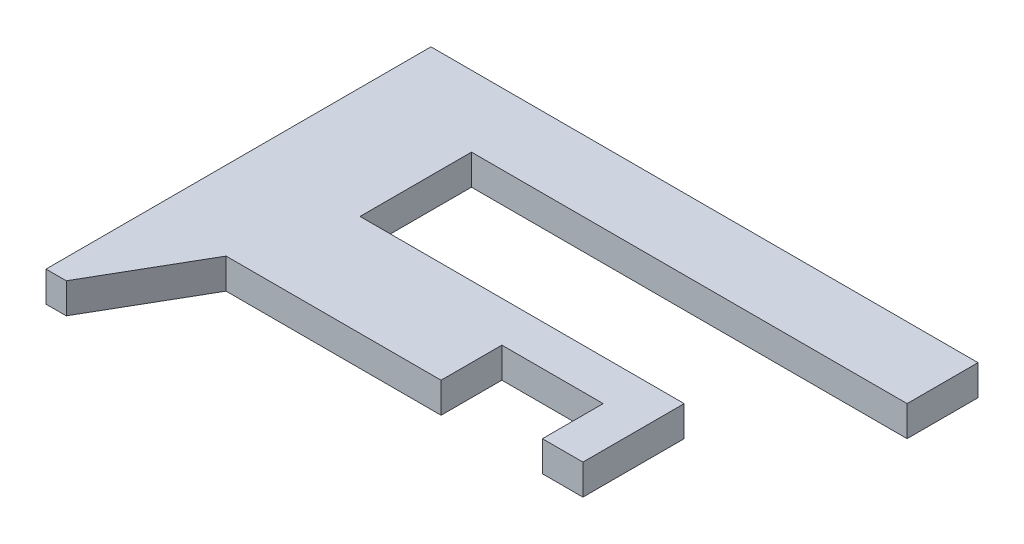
ISO-10303-21;
HEADER;
FILE_DESCRIPTION(('STEP AP214'),'2;1');
FILE_NAME('part.step','',(''),(''),'','','');
FILE_SCHEMA(('AUTOMOTIVE_DESIGN { 1 0 10303 214 1 1 1 1 }'));
ENDSEC;
DATA;
#1=APPLICATION_CONTEXT('core data for automotive mechanical design processes');
#2=APPLICATION_PROTOCOL_DEFINITION('international standard','automotive_design',2000,#1);
#3=PRODUCT_CONTEXT('',#1,'mechanical');
#4=PRODUCT('Part','Part','',(#3));
#5=PRODUCT_RELATED_PRODUCT_CATEGORY('part','',(#4));
#6=PRODUCT_DEFINITION_FORMATION('','',#4);
#7=PRODUCT_DEFINITION_CONTEXT('part definition',#1,'design');
#8=PRODUCT_DEFINITION('design','',#6,#7);
#9=PRODUCT_DEFINITION_SHAPE('','',#8);
#10=(LENGTH_UNIT() NAMED_UNIT(*) SI_UNIT(.MILLI.,.METRE.));
#11=(NAMED_UNIT(*) PLANE_ANGLE_UNIT() SI_UNIT($,.RADIAN.));
#12=(NAMED_UNIT(*) SI_UNIT($,.STERADIAN.) SOLID_ANGLE_UNIT());
#13=UNCERTAINTY_MEASURE_WITH_UNIT(LENGTH_MEASURE(1.E-05),#10,'distance_accuracy_value','');
#14=(GEOMETRIC_REPRESENTATION_CONTEXT(3) GLOBAL_UNCERTAINTY_ASSIGNED_CONTEXT((#13)) GLOBAL_UNIT_ASSIGNED_CONTEXT((#10,
#11,#12)) REPRESENTATION_CONTEXT('',''));
#15=CARTESIAN_POINT('',(0.,0.,0.));
#16=DIRECTION('',(0.,0.,1.));
#17=DIRECTION('',(1.,0.,0.));
#18=AXIS2_PLACEMENT_3D('',#15,#16,#17);
#19=CARTESIAN_POINT('',(0.,3.,-38.));
#20=DIRECTION('',(1.,0.,0.));
#21=DIRECTION('',(0.,0.,-1.));
#22=AXIS2_PLACEMENT_3D('',#19,#20,#21);
#23=PLANE('',#22);
#24=DIRECTION('',(0.,0.,1.));
#25=VECTOR('',#24,1.);
#26=CARTESIAN_POINT('',(0.,0.,-38.));
#27=LINE('',#26,#25);
#28=CARTESIAN_POINT('',(0.,0.,-38.));
#29=VERTEX_POINT('',#28);
#30=CARTESIAN_POINT('',(0.,0.,0.));
#31=VERTEX_POINT('',#30);
#32=EDGE_CURVE('E163',#29,#31,#27,.T.);
#33=ORIENTED_EDGE('',*,*,#32,.T.);
#34=DIRECTION('',(0.,-1.,0.));
#35=VECTOR('',#34,1.);
#36=CARTESIAN_POINT('',(0.,3.,0.));
#37=LINE('',#36,#35);
#38=CARTESIAN_POINT('',(0.,3.,0.));
#39=VERTEX_POINT('',#38);
#40=EDGE_CURVE('E11',#39,#31,#37,.T.);
#41=ORIENTED_EDGE('',*,*,#40,.F.);
#42=DIRECTION('',(0.,0.,1.));
#43=VECTOR('',#42,1.);
#44=CARTESIAN_POINT('',(0.,3.,-38.));
#45=LINE('',#44,#43);
#46=CARTESIAN_POINT('',(0.,3.,-38.));
#47=VERTEX_POINT('',#46);
#48=EDGE_CURVE('E189',#47,#39,#45,.T.);
#49=ORIENTED_EDGE('',*,*,#48,.F.);
#50=DIRECTION('',(0.,-1.,0.));
#51=VECTOR('',#50,1.);
#52=CARTESIAN_POINT('',(0.,3.,-38.));
#53=LINE('',#52,#51);
#54=EDGE_CURVE('E159',#47,#29,#53,.T.);
#55=ORIENTED_EDGE('',*,*,#54,.T.);
#56=EDGE_LOOP('',(#33,#41,#49,#55));
#57=FACE_BOUND('',#56,.T.);
#58=ADVANCED_FACE('F31',(#57),#23,.F.);
#59=CARTESIAN_POINT('',(0.,3.,0.));
#60=DIRECTION('',(0.,0.,-1.));
#61=DIRECTION('',(-1.,0.,0.));
#62=AXIS2_PLACEMENT_3D('',#59,#60,#61);
#63=PLANE('',#62);
#64=DIRECTION('',(1.,0.,0.));
#65=VECTOR('',#64,1.);
#66=CARTESIAN_POINT('',(0.,0.,0.));
#67=LINE('',#66,#65);
#68=CARTESIAN_POINT('',(2.,0.,0.));
#69=VERTEX_POINT('',#68);
#70=EDGE_CURVE('E166',#31,#69,#67,.T.);
#71=ORIENTED_EDGE('',*,*,#70,.T.);
#72=DIRECTION('',(0.,-1.,0.));
#73=VECTOR('',#72,1.);
#74=CARTESIAN_POINT('',(2.,3.,0.));
#75=LINE('',#74,#73);
#76=CARTESIAN_POINT('',(2.,3.,0.));
#77=VERTEX_POINT('',#76);
#78=EDGE_CURVE('E39',#77,#69,#75,.T.);
#79=ORIENTED_EDGE('',*,*,#78,.F.);
#80=DIRECTION('',(1.,0.,0.));
#81=VECTOR('',#80,1.);
#82=CARTESIAN_POINT('',(0.,3.,0.));
#83=LINE('',#82,#81);
#84=EDGE_CURVE('E108',#39,#77,#83,.T.);
#85=ORIENTED_EDGE('',*,*,#84,.F.);
#86=ORIENTED_EDGE('',*,*,#40,.T.);
#87=EDGE_LOOP('',(#71,#79,#85,#86));
#88=FACE_BOUND('',#87,.T.);
#89=ADVANCED_FACE('F277',(#88),#63,.F.);
#90=CARTESIAN_POINT('',(2.,3.,0.));
#91=DIRECTION('',(-0.86602540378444,0.,-0.499999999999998));
#92=DIRECTION('',(-0.499999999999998,0.,0.86602540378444));
#93=AXIS2_PLACEMENT_3D('',#90,#91,#92);
#94=PLANE('',#93);
#95=DIRECTION('',(0.499999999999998,0.,-0.86602540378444));
#96=VECTOR('',#95,1.);
#97=CARTESIAN_POINT('',(2.,0.,0.));
#98=LINE('',#97,#96);
#99=CARTESIAN_POINT('',(7.77350269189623,0.,-10.));
#100=VERTEX_POINT('',#99);
#101=EDGE_CURVE('E168',#69,#100,#98,.T.);
#102=ORIENTED_EDGE('',*,*,#101,.T.);
#103=DIRECTION('',(0.,-1.,0.));
#104=VECTOR('',#103,1.);
#105=CARTESIAN_POINT('',(7.77350269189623,3.,-10.));
#106=LINE('',#105,#104);
#107=CARTESIAN_POINT('',(7.77350269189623,3.,-10.));
#108=VERTEX_POINT('',#107);
#109=EDGE_CURVE('E214',#108,#100,#106,.T.);
#110=ORIENTED_EDGE('',*,*,#109,.F.);
#111=DIRECTION('',(0.499999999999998,0.,-0.86602540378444));
#112=VECTOR('',#111,1.);
#113=CARTESIAN_POINT('',(2.,3.,0.));
#114=LINE('',#113,#112);
#115=EDGE_CURVE('E222',#77,#108,#114,.T.);
#116=ORIENTED_EDGE('',*,*,#115,.F.);
#117=ORIENTED_EDGE('',*,*,#78,.T.);
#118=EDGE_LOOP('',(#102,#110,#116,#117));
#119=FACE_BOUND('',#118,.T.);
#120=ADVANCED_FACE('F220',(#119),#94,.F.);
#121=CARTESIAN_POINT('',(7.77350269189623,3.,-10.));
#122=DIRECTION('',(0.,0.,-1.));
#123=DIRECTION('',(-1.,0.,0.));
#124=AXIS2_PLACEMENT_3D('',#121,#122,#123);
#125=PLANE('',#124);
#126=DIRECTION('',(1.,0.,0.));
#127=VECTOR('',#126,1.);
#128=CARTESIAN_POINT('',(7.77350269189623,0.,-10.));
#129=LINE('',#128,#127);
#130=CARTESIAN_POINT('',(29.,0.,-10.));
#131=VERTEX_POINT('',#130);
#132=EDGE_CURVE('E170',#100,#131,#129,.T.);
#133=ORIENTED_EDGE('',*,*,#132,.T.);
#134=DIRECTION('',(0.,-1.,0.));
#135=VECTOR('',#134,1.);
#136=CARTESIAN_POINT('',(29.,3.,-10.));
#137=LINE('',#136,#135);
#138=CARTESIAN_POINT('',(29.,3.,-10.));
#139=VERTEX_POINT('',#138);
#140=EDGE_CURVE('E211',#139,#131,#137,.T.);
#141=ORIENTED_EDGE('',*,*,#140,.F.);
#142=DIRECTION('',(1.,0.,0.));
#143=VECTOR('',#142,1.);
#144=CARTESIAN_POINT('',(7.77350269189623,3.,-10.));
#145=LINE('',#144,#143);
#146=EDGE_CURVE('E240',#108,#139,#145,.T.);
#147=ORIENTED_EDGE('',*,*,#146,.F.);
#148=ORIENTED_EDGE('',*,*,#109,.T.);
#149=EDGE_LOOP('',(#133,#141,#147,#148));
#150=FACE_BOUND('',#149,.T.);
#151=ADVANCED_FACE('F231',(#150),#125,.F.);
#152=CARTESIAN_POINT('',(29.,3.,-10.));
#153=DIRECTION('',(-1.,0.,0.));
#154=DIRECTION('',(0.,0.,1.));
#155=AXIS2_PLACEMENT_3D('',#152,#153,#154);
#156=PLANE('',#155);
#157=DIRECTION('',(0.,0.,-1.));
#158=VECTOR('',#157,1.);
#159=CARTESIAN_POINT('',(29.,0.,-10.));
#160=LINE('',#159,#158);
#161=CARTESIAN_POINT('',(29.,0.,-16.));
#162=VERTEX_POINT('',#161);
#163=EDGE_CURVE('E172',#131,#162,#160,.T.);
#164=ORIENTED_EDGE('',*,*,#163,.T.);
#165=DIRECTION('',(0.,-1.,0.));
#166=VECTOR('',#165,1.);
#167=CARTESIAN_POINT('',(29.,3.,-16.));
#168=LINE('',#167,#166);
#169=CARTESIAN_POINT('',(29.,3.,-16.));
#170=VERTEX_POINT('',#169);
#171=EDGE_CURVE('E208',#170,#162,#168,.T.);
#172=ORIENTED_EDGE('',*,*,#171,.F.);
#173=DIRECTION('',(0.,0.,-1.));
#174=VECTOR('',#173,1.);
#175=CARTESIAN_POINT('',(29.,3.,-10.));
#176=LINE('',#175,#174);
#177=EDGE_CURVE('E237',#139,#170,#176,.T.);
#178=ORIENTED_EDGE('',*,*,#177,.F.);
#179=ORIENTED_EDGE('',*,*,#140,.T.);
#180=EDGE_LOOP('',(#164,#172,#178,#179));
#181=FACE_BOUND('',#180,.T.);
#182=ADVANCED_FACE('F235',(#181),#156,.F.);
#183=CARTESIAN_POINT('',(29.,3.,-16.));
#184=DIRECTION('',(0.,0.,-1.));
#185=DIRECTION('',(-1.,0.,0.));
#186=AXIS2_PLACEMENT_3D('',#183,#184,#185);
#187=PLANE('',#186);
#188=DIRECTION('',(1.,0.,0.));
#189=VECTOR('',#188,1.);
#190=CARTESIAN_POINT('',(29.,0.,-16.));
#191=LINE('',#190,#189);
#192=CARTESIAN_POINT('',(39.,0.,-16.));
#193=VERTEX_POINT('',#192);
#194=EDGE_CURVE('E174',#162,#193,#191,.T.);
#195=ORIENTED_EDGE('',*,*,#194,.T.);
#196=DIRECTION('',(0.,-1.,0.));
#197=VECTOR('',#196,1.);
#198=CARTESIAN_POINT('',(39.,3.,-16.));
#199=LINE('',#198,#197);
#200=CARTESIAN_POINT('',(39.,3.,-16.));
#201=VERTEX_POINT('',#200);
#202=EDGE_CURVE('E205',#201,#193,#199,.T.);
#203=ORIENTED_EDGE('',*,*,#202,.F.);
#204=DIRECTION('',(1.,0.,0.));
#205=VECTOR('',#204,1.);
#206=CARTESIAN_POINT('',(29.,3.,-16.));
#207=LINE('',#206,#205);
#208=EDGE_CURVE('E239',#170,#201,#207,.T.);
#209=ORIENTED_EDGE('',*,*,#208,.F.);
#210=ORIENTED_EDGE('',*,*,#171,.T.);
#211=EDGE_LOOP('',(#195,#203,#209,#210));
#212=FACE_BOUND('',#211,.T.);
#213=ADVANCED_FACE('F290',(#212),#187,.F.);
#214=CARTESIAN_POINT('',(39.,3.,-16.));
#215=DIRECTION('',(1.,0.,0.));
#216=DIRECTION('',(0.,0.,-1.));
#217=AXIS2_PLACEMENT_3D('',#214,#215,#216);
#218=PLANE('',#217);
#219=DIRECTION('',(0.,0.,1.));
#220=VECTOR('',#219,1.);
#221=CARTESIAN_POINT('',(39.,0.,-16.));
#222=LINE('',#221,#220);
#223=CARTESIAN_POINT('',(39.,0.,-10.));
#224=VERTEX_POINT('',#223);
#225=EDGE_CURVE('E176',#193,#224,#222,.T.);
#226=ORIENTED_EDGE('',*,*,#225,.T.);
#227=DIRECTION('',(0.,-1.,0.));
#228=VECTOR('',#227,1.);
#229=CARTESIAN_POINT('',(39.,3.,-10.));
#230=LINE('',#229,#228);
#231=CARTESIAN_POINT('',(39.,3.,-10.));
#232=VERTEX_POINT('',#231);
#233=EDGE_CURVE('E202',#232,#224,#230,.T.);
#234=ORIENTED_EDGE('',*,*,#233,.F.);
#235=DIRECTION('',(0.,0.,1.));
#236=VECTOR('',#235,1.);
#237=CARTESIAN_POINT('',(39.,3.,-16.));
#238=LINE('',#237,#236);
#239=EDGE_CURVE('E242',#201,#232,#238,.T.);
#240=ORIENTED_EDGE('',*,*,#239,.F.);
#241=ORIENTED_EDGE('',*,*,#202,.T.);
#242=EDGE_LOOP('',(#226,#234,#240,#241));
#243=FACE_BOUND('',#242,.T.);
#244=ADVANCED_FACE('F293',(#243),#218,.F.);
#245=CARTESIAN_POINT('',(39.,3.,-10.));
#246=DIRECTION('',(0.,0.,-1.));
#247=DIRECTION('',(-1.,0.,0.));
#248=AXIS2_PLACEMENT_3D('',#245,#246,#247);
#249=PLANE('',#248);
#250=DIRECTION('',(1.,0.,0.));
#251=VECTOR('',#250,1.);
#252=CARTESIAN_POINT('',(39.,0.,-10.));
#253=LINE('',#252,#251);
#254=CARTESIAN_POINT('',(43.,0.,-10.));
#255=VERTEX_POINT('',#254);
#256=EDGE_CURVE('E178',#224,#255,#253,.T.);
#257=ORIENTED_EDGE('',*,*,#256,.T.);
#258=DIRECTION('',(0.,-1.,0.));
#259=VECTOR('',#258,1.);
#260=CARTESIAN_POINT('',(43.,3.,-10.));
#261=LINE('',#260,#259);
#262=CARTESIAN_POINT('',(43.,3.,-10.));
#263=VERTEX_POINT('',#262);
#264=EDGE_CURVE('E199',#263,#255,#261,.T.);
#265=ORIENTED_EDGE('',*,*,#264,.F.);
#266=DIRECTION('',(1.,0.,0.));
#267=VECTOR('',#266,1.);
#268=CARTESIAN_POINT('',(39.,3.,-10.));
#269=LINE('',#268,#267);
#270=EDGE_CURVE('E248',#232,#263,#269,.T.);
#271=ORIENTED_EDGE('',*,*,#270,.F.);
#272=ORIENTED_EDGE('',*,*,#233,.T.);
#273=EDGE_LOOP('',(#257,#265,#271,#272));
#274=FACE_BOUND('',#273,.T.);
#275=ADVANCED_FACE('F297',(#274),#249,.F.);
#276=CARTESIAN_POINT('',(43.,3.,-10.));
#277=DIRECTION('',(-1.,0.,0.));
#278=DIRECTION('',(0.,0.,1.));
#279=AXIS2_PLACEMENT_3D('',#276,#277,#278);
#280=PLANE('',#279);
#281=DIRECTION('',(0.,0.,-1.));
#282=VECTOR('',#281,1.);
#283=CARTESIAN_POINT('',(43.,0.,-10.));
#284=LINE('',#283,#282);
#285=CARTESIAN_POINT('',(43.,0.,-20.));
#286=VERTEX_POINT('',#285);
#287=EDGE_CURVE('E180',#255,#286,#284,.T.);
#288=ORIENTED_EDGE('',*,*,#287,.T.);
#289=DIRECTION('',(0.,-1.,0.));
#290=VECTOR('',#289,1.);
#291=CARTESIAN_POINT('',(43.,3.,-20.));
#292=LINE('',#291,#290);
#293=CARTESIAN_POINT('',(43.,3.,-20.));
#294=VERTEX_POINT('',#293);
#295=EDGE_CURVE('E196',#294,#286,#292,.T.);
#296=ORIENTED_EDGE('',*,*,#295,.F.);
#297=DIRECTION('',(0.,0.,-1.));
#298=VECTOR('',#297,1.);
#299=CARTESIAN_POINT('',(43.,3.,-10.));
#300=LINE('',#299,#298);
#301=EDGE_CURVE('E250',#263,#294,#300,.T.);
#302=ORIENTED_EDGE('',*,*,#301,.F.);
#303=ORIENTED_EDGE('',*,*,#264,.T.);
#304=EDGE_LOOP('',(#288,#296,#302,#303));
#305=FACE_BOUND('',#304,.T.);
#306=ADVANCED_FACE('F301',(#305),#280,.F.);
#307=CARTESIAN_POINT('',(43.,3.,-20.));
#308=DIRECTION('',(0.,0.,1.));
#309=DIRECTION('',(1.,0.,0.));
#310=AXIS2_PLACEMENT_3D('',#307,#308,#309);
#311=PLANE('',#310);
#312=DIRECTION('',(-1.,0.,0.));
#313=VECTOR('',#312,1.);
#314=CARTESIAN_POINT('',(43.,0.,-20.));
#315=LINE('',#314,#313);
#316=CARTESIAN_POINT('',(11.,0.,-20.));
#317=VERTEX_POINT('',#316);
#318=EDGE_CURVE('E182',#286,#317,#315,.T.);
#319=ORIENTED_EDGE('',*,*,#318,.T.);
#320=DIRECTION('',(0.,-1.,0.));
#321=VECTOR('',#320,1.);
#322=CARTESIAN_POINT('',(11.,3.,-20.));
#323=LINE('',#322,#321);
#324=CARTESIAN_POINT('',(11.,3.,-20.));
#325=VERTEX_POINT('',#324);
#326=EDGE_CURVE('E193',#325,#317,#323,.T.);
#327=ORIENTED_EDGE('',*,*,#326,.F.);
#328=DIRECTION('',(-1.,0.,0.));
#329=VECTOR('',#328,1.);
#330=CARTESIAN_POINT('',(43.,3.,-20.));
#331=LINE('',#330,#329);
#332=EDGE_CURVE('E252',#294,#325,#331,.T.);
#333=ORIENTED_EDGE('',*,*,#332,.F.);
#334=ORIENTED_EDGE('',*,*,#295,.T.);
#335=EDGE_LOOP('',(#319,#327,#333,#334));
#336=FACE_BOUND('',#335,.T.);
#337=ADVANCED_FACE('F258',(#336),#311,.F.);
#338=CARTESIAN_POINT('',(11.,3.,-20.));
#339=DIRECTION('',(-1.,0.,0.));
#340=DIRECTION('',(0.,0.,1.));
#341=AXIS2_PLACEMENT_3D('',#338,#339,#340);
#342=PLANE('',#341);
#343=DIRECTION('',(0.,0.,-1.));
#344=VECTOR('',#343,1.);
#345=CARTESIAN_POINT('',(11.,0.,-20.));
#346=LINE('',#345,#344);
#347=CARTESIAN_POINT('',(11.,0.,-31.));
#348=VERTEX_POINT('',#347);
#349=EDGE_CURVE('E184',#317,#348,#346,.T.);
#350=ORIENTED_EDGE('',*,*,#349,.T.);
#351=DIRECTION('',(0.,-1.,0.));
#352=VECTOR('',#351,1.);
#353=CARTESIAN_POINT('',(11.,3.,-31.));
#354=LINE('',#353,#352);
#355=CARTESIAN_POINT('',(11.,3.,-31.));
#356=VERTEX_POINT('',#355);
#357=EDGE_CURVE('E154',#356,#348,#354,.T.);
#358=ORIENTED_EDGE('',*,*,#357,.F.);
#359=DIRECTION('',(0.,0.,-1.));
#360=VECTOR('',#359,1.);
#361=CARTESIAN_POINT('',(11.,3.,-20.));
#362=LINE('',#361,#360);
#363=EDGE_CURVE('E145',#325,#356,#362,.T.);
#364=ORIENTED_EDGE('',*,*,#363,.F.);
#365=ORIENTED_EDGE('',*,*,#326,.T.);
#366=EDGE_LOOP('',(#350,#358,#364,#365));
#367=FACE_BOUND('',#366,.T.);
#368=ADVANCED_FACE('F262',(#367),#342,.F.);
#369=CARTESIAN_POINT('',(11.,3.,-31.));
#370=DIRECTION('',(0.,0.,-1.));
#371=DIRECTION('',(-1.,0.,0.));
#372=AXIS2_PLACEMENT_3D('',#369,#370,#371);
#373=PLANE('',#372);
#374=DIRECTION('',(1.,0.,0.));
#375=VECTOR('',#374,1.);
#376=CARTESIAN_POINT('',(11.,0.,-31.));
#377=LINE('',#376,#375);
#378=CARTESIAN_POINT('',(54.,0.,-31.));
#379=VERTEX_POINT('',#378);
#380=EDGE_CURVE('E153',#348,#379,#377,.T.);
#381=ORIENTED_EDGE('',*,*,#380,.T.);
#382=DIRECTION('',(0.,-1.,0.));
#383=VECTOR('',#382,1.);
#384=CARTESIAN_POINT('',(54.,3.,-31.));
#385=LINE('',#384,#383);
#386=CARTESIAN_POINT('',(54.,3.,-31.));
#387=VERTEX_POINT('',#386);
#388=EDGE_CURVE('E150',#387,#379,#385,.T.);
#389=ORIENTED_EDGE('',*,*,#388,.F.);
#390=DIRECTION('',(1.,0.,0.));
#391=VECTOR('',#390,1.);
#392=CARTESIAN_POINT('',(11.,3.,-31.));
#393=LINE('',#392,#391);
#394=EDGE_CURVE('E139',#356,#387,#393,.T.);
#395=ORIENTED_EDGE('',*,*,#394,.F.);
#396=ORIENTED_EDGE('',*,*,#357,.T.);
#397=EDGE_LOOP('',(#381,#389,#395,#396));
#398=FACE_BOUND('',#397,.T.);
#399=ADVANCED_FACE('F151',(#398),#373,.F.);
#400=CARTESIAN_POINT('',(54.,3.,-31.));
#401=DIRECTION('',(-1.,0.,0.));
#402=DIRECTION('',(0.,0.,1.));
#403=AXIS2_PLACEMENT_3D('',#400,#401,#402);
#404=PLANE('',#403);
#405=DIRECTION('',(0.,0.,-1.));
#406=VECTOR('',#405,1.);
#407=CARTESIAN_POINT('',(54.,0.,-31.));
#408=LINE('',#407,#406);
#409=CARTESIAN_POINT('',(54.,0.,-38.));
#410=VERTEX_POINT('',#409);
#411=EDGE_CURVE('E94',#379,#410,#408,.T.);
#412=ORIENTED_EDGE('',*,*,#411,.T.);
#413=DIRECTION('',(0.,-1.,0.));
#414=VECTOR('',#413,1.);
#415=CARTESIAN_POINT('',(54.,3.,-38.));
#416=LINE('',#415,#414);
#417=CARTESIAN_POINT('',(54.,3.,-38.));
#418=VERTEX_POINT('',#417);
#419=EDGE_CURVE('E155',#418,#410,#416,.T.);
#420=ORIENTED_EDGE('',*,*,#419,.F.);
#421=DIRECTION('',(0.,0.,-1.));
#422=VECTOR('',#421,1.);
#423=CARTESIAN_POINT('',(54.,3.,-31.));
#424=LINE('',#423,#422);
#425=EDGE_CURVE('E143',#387,#418,#424,.T.);
#426=ORIENTED_EDGE('',*,*,#425,.F.);
#427=ORIENTED_EDGE('',*,*,#388,.T.);
#428=EDGE_LOOP('',(#412,#420,#426,#427));
#429=FACE_BOUND('',#428,.T.);
#430=ADVANCED_FACE('F157',(#429),#404,.F.);
#431=CARTESIAN_POINT('',(54.,3.,-38.));
#432=DIRECTION('',(0.,0.,1.));
#433=DIRECTION('',(1.,0.,0.));
#434=AXIS2_PLACEMENT_3D('',#431,#432,#433);
#435=PLANE('',#434);
#436=DIRECTION('',(-1.,0.,0.));
#437=VECTOR('',#436,1.);
#438=CARTESIAN_POINT('',(54.,0.,-38.));
#439=LINE('',#438,#437);
#440=EDGE_CURVE('E100',#410,#29,#439,.T.);
#441=ORIENTED_EDGE('',*,*,#440,.T.);
#442=ORIENTED_EDGE('',*,*,#54,.F.);
#443=DIRECTION('',(-1.,0.,0.));
#444=VECTOR('',#443,1.);
#445=CARTESIAN_POINT('',(54.,3.,-38.));
#446=LINE('',#445,#444);
#447=EDGE_CURVE('E47',#418,#47,#446,.T.);
#448=ORIENTED_EDGE('',*,*,#447,.F.);
#449=ORIENTED_EDGE('',*,*,#419,.T.);
#450=EDGE_LOOP('',(#441,#442,#448,#449));
#451=FACE_BOUND('',#450,.T.);
#452=ADVANCED_FACE('F266',(#451),#435,.F.);
#453=CARTESIAN_POINT('',(0.,3.,0.));
#454=DIRECTION('',(0.,1.,0.));
#455=DIRECTION('',(0.,0.,1.));
#456=AXIS2_PLACEMENT_3D('',#453,#454,#455);
#457=PLANE('',#456);
#458=ORIENTED_EDGE('',*,*,#48,.T.);
#459=ORIENTED_EDGE('',*,*,#84,.T.);
#460=ORIENTED_EDGE('',*,*,#115,.T.);
#461=ORIENTED_EDGE('',*,*,#146,.T.);
#462=ORIENTED_EDGE('',*,*,#177,.T.);
#463=ORIENTED_EDGE('',*,*,#208,.T.);
#464=ORIENTED_EDGE('',*,*,#239,.T.);
#465=ORIENTED_EDGE('',*,*,#270,.T.);
#466=ORIENTED_EDGE('',*,*,#301,.T.);
#467=ORIENTED_EDGE('',*,*,#332,.T.);
#468=ORIENTED_EDGE('',*,*,#363,.T.);
#469=ORIENTED_EDGE('',*,*,#394,.T.);
#470=ORIENTED_EDGE('',*,*,#425,.T.);
#471=ORIENTED_EDGE('',*,*,#447,.T.);
#472=EDGE_LOOP('',(#458,#459,#460,#461,#462,#463,#464,#465,#466,#467,#468,#469,#470,#471));
#473=FACE_BOUND('',#472,.T.);
#474=ADVANCED_FACE('F141',(#473),#457,.T.);
#475=CARTESIAN_POINT('',(0.,0.,0.));
#476=DIRECTION('',(0.,1.,0.));
#477=DIRECTION('',(0.,0.,1.));
#478=AXIS2_PLACEMENT_3D('',#475,#476,#477);
#479=PLANE('',#478);
#480=ORIENTED_EDGE('',*,*,#32,.F.);
#481=ORIENTED_EDGE('',*,*,#440,.F.);
#482=ORIENTED_EDGE('',*,*,#411,.F.);
#483=ORIENTED_EDGE('',*,*,#380,.F.);
#484=ORIENTED_EDGE('',*,*,#349,.F.);
#485=ORIENTED_EDGE('',*,*,#318,.F.);
#486=ORIENTED_EDGE('',*,*,#287,.F.);
#487=ORIENTED_EDGE('',*,*,#256,.F.);
#488=ORIENTED_EDGE('',*,*,#225,.F.);
#489=ORIENTED_EDGE('',*,*,#194,.F.);
#490=ORIENTED_EDGE('',*,*,#163,.F.);
#491=ORIENTED_EDGE('',*,*,#132,.F.);
#492=ORIENTED_EDGE('',*,*,#101,.F.);
#493=ORIENTED_EDGE('',*,*,#70,.F.);
#494=EDGE_LOOP('',(#480,#481,#482,#483,#484,#485,#486,#487,#488,#489,#490,#491,#492,#493));
#495=FACE_BOUND('',#494,.T.);
#496=ADVANCED_FACE('F226',(#495),#479,.F.);
#497=CLOSED_SHELL('',(#58,#89,#120,#151,#182,#213,#244,#275,#306,#337,#368,#399,#430,#452,#474,#496));
#498=MANIFOLD_SOLID_BREP('B2',#497);
#499=ADVANCED_BREP_SHAPE_REPRESENTATION('',(#18,#498),#14);
#500=SHAPE_DEFINITION_REPRESENTATION(#9,#499);
ENDSEC;
END-ISO-10303-21;
